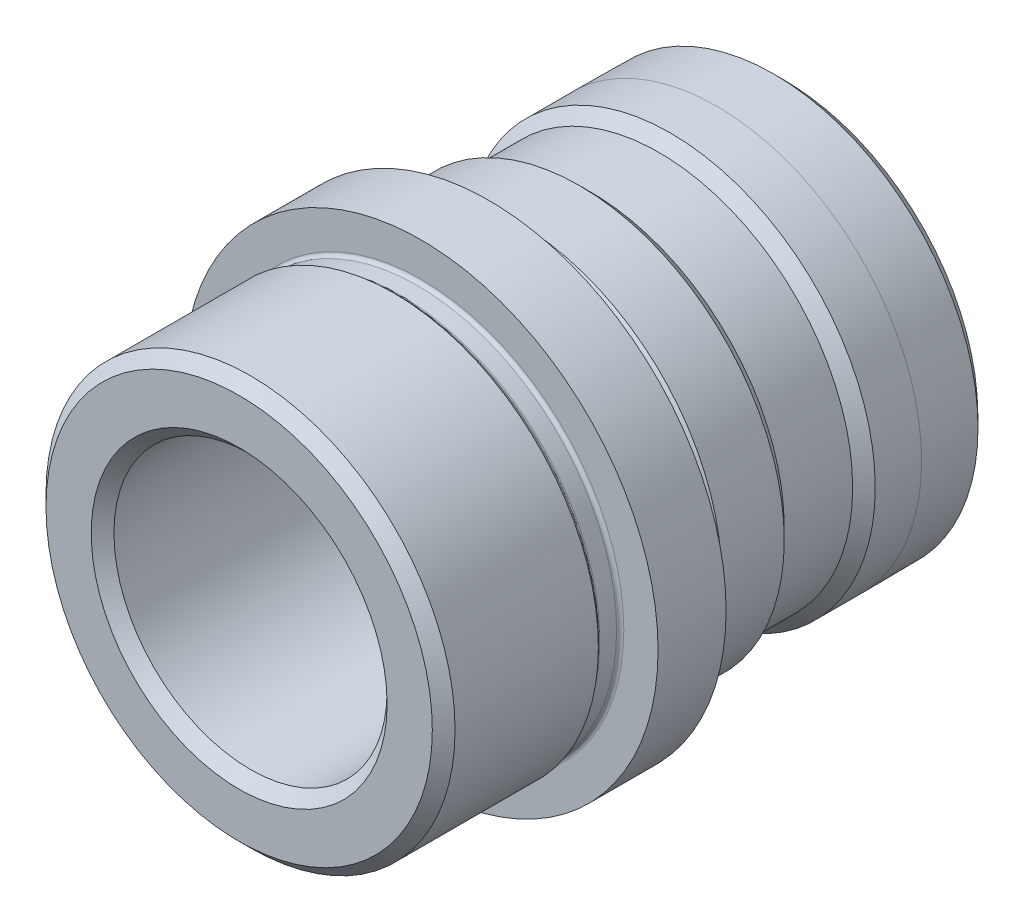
from build123d import *
from OCP.BRepFilletAPI import BRepFilletAPI_MakeChamfer

# Parameters (mm, degrees)
SKETCH2_R          = 2.3749
CUT_EXTRUDE1_DEPTH = 35.525337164
FILLET1_R          = 3.048
CHAMFER1_SIZE      = 0.79375
CHAMFER1_SIZE2     = 0.800768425
FILLET2_R          = 0.254


with BuildPart() as part:
    # Sketch1 → Revolve1 (revolve)
    with BuildSketch(Plane(origin=(0, 0, 0), x_dir=(0, 0, -1), z_dir=(1, 0, 0)), mode=Mode.PRIVATE) as revolve1_sk:
        Polygon((-12.7, 9.53262), (25.4, 9.53262), (25.4, 14.252288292), (20.6375, 14.29385), (17.399, 14.29385), (16.6116, 13.50645), (11.8364, 13.50645), (11.049, 14.29385), (6.67385, 14.29385), (6.2738, 13.8938), (4.7498, 13.8938), (4.7498, 16.5354), (0, 16.5354), (0, 13.8938), (-1.524, 13.8938), (-1.905, 14.2748), (-12.7, 14.2748), align=None)
    revolve(revolve1_sk.sketch.rotate(Axis((0, 0, 0), (0, 0, 1)), 90), axis=Axis((0, 0, 0), (0, 0, 1)))

    # Sketch2 → Cut-Extrude1 (cut, through all)
    with BuildSketch(Plane(origin=(0, 0, 0), x_dir=(1, 0, 0), z_dir=(0, 1, 0))):
        with Locations(Location((0, 14.224, 0), (0, 0, 270))):
            Circle(SKETCH2_R)
    extrude(amount=-CUT_EXTRUDE1_DEPTH, mode=Mode.SUBTRACT)

    # Fillet1
    fillet1_edges = [part.edges().sort_by_distance(p)[0] for p in [
        (9.53262, 0, -25.4),
    ]]
    fillet(fillet1_edges, radius=FILLET1_R)

    # Chamfer1: one chamfer whose edges measure the first distance from different faces: ONE call of the kernel's chamfer builder (chamfer() names one face for all edges)
    chamfer1_edges_1 = [part.edges().sort_by_distance(p)[0] for p in [
        (9.53262, 0, 12.7),
        (14.2748, 0, 12.7),
    ]]
    chamfer1_edges_2 = [part.edges().sort_by_distance(p)[0] for p in [
        (14.252288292, 0, -25.4),
    ]]
    chamfer1_side_2 = [part.faces().sort_by_distance(p)[0] for p in [
        (14.273069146, 0, -23.01875),
    ]]
    chamfer1 = BRepFilletAPI_MakeChamfer(part.part.solid().wrapped)
    for e in chamfer1_edges_1:
        chamfer1.Add(CHAMFER1_SIZE, e.wrapped)
    for e in chamfer1_edges_2:
        chamfer1.Add(CHAMFER1_SIZE, CHAMFER1_SIZE2, e.wrapped, chamfer1_side_2[0].wrapped)  # the first distance lies on this face
    add(Compound.cast(chamfer1.Shape()), mode=Mode.REPLACE)

    # Fillet2
    fillet2_edges = [part.edges().sort_by_distance(p)[0] for p in [
        (13.8938, 0, -6.2738),
        (13.8938, 0, -4.7498),
        (13.8938, 0, 0),
        (13.8938, 0, 1.524),
    ]]
    fillet(fillet2_edges, radius=FILLET2_R)


solid = part.part
